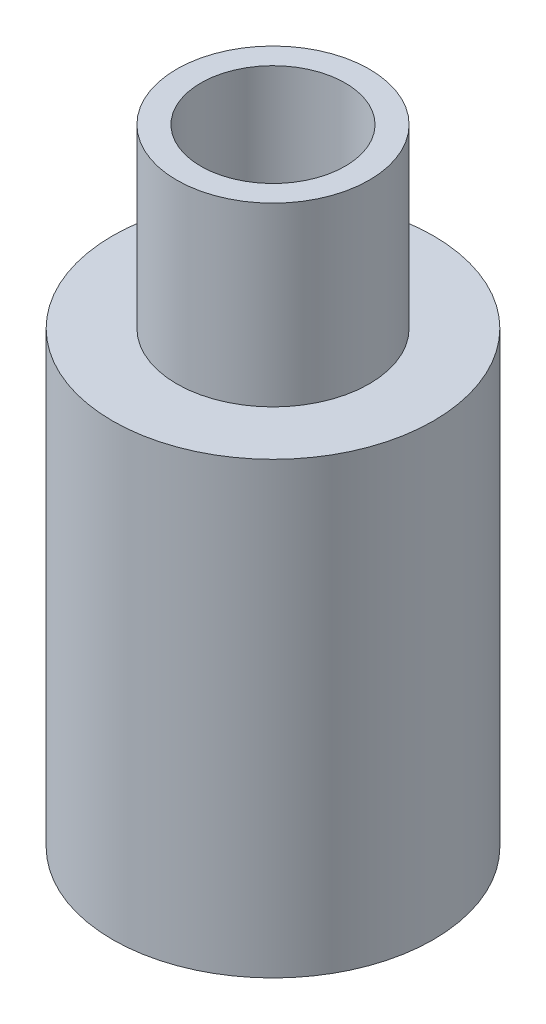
from build123d import *

# Parameters (mm, degrees)
SKETCH1_R      = 5
EXTRUDE1_DEPTH = 14
SKETCH2_R      = 3
EXTRUDE2_DEPTH = 5.5
SKETCH3_R      = 2.25
EXTRUDE3_DEPTH = 21.742468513


with BuildPart() as part:
    # Sketch1 → Extrude1 (new body)
    with BuildSketch(Plane(origin=(0, 0, 0), x_dir=(1, 0, 0), z_dir=(0, 1, 0))):
        with Locations(Location((0, 0, 0), (0, 0, 270))):
            Circle(SKETCH1_R)
    extrude(amount=EXTRUDE1_DEPTH)

    # Sketch2 → Extrude2 (add)
    with BuildSketch(Plane(origin=(0, 14, 0), x_dir=(1, 0, 0), z_dir=(0, 1, 0))):
        with Locations(Location((0, 0, 0), (0, 0, 270))):
            Circle(SKETCH2_R)
    extrude(amount=EXTRUDE2_DEPTH)

    # Sketch3 → Extrude3 (cut, through all)
    with BuildSketch(Plane(origin=(0, 19.5, 0), x_dir=(1, 0, 0), z_dir=(0, 1, 0))):
        with Locations(Location((0, 0, 0), (0, 0, 270))):
            Circle(SKETCH3_R)
    extrude(amount=-EXTRUDE3_DEPTH, mode=Mode.SUBTRACT)


solid = part.part
